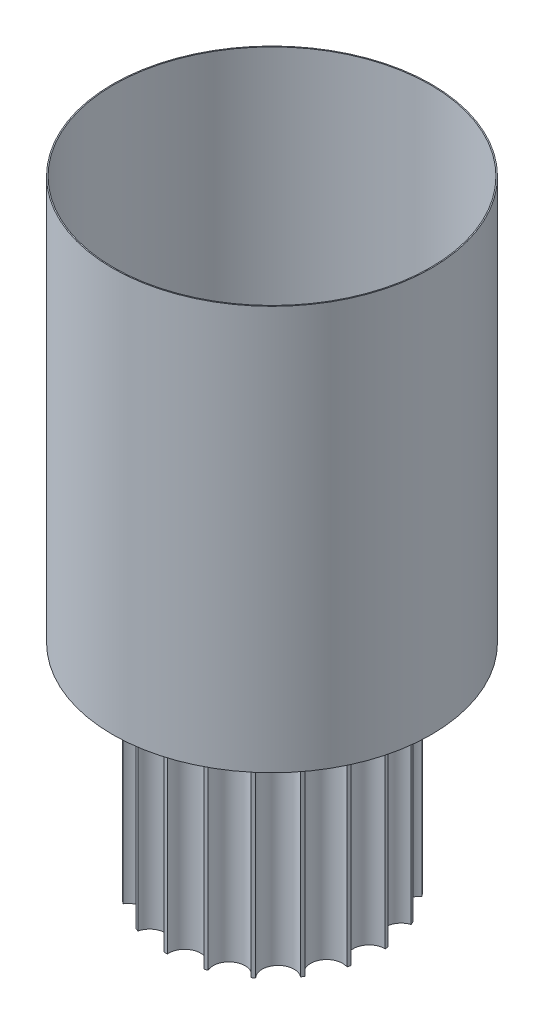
from build123d import *

# Parameters (mm, degrees)
CROQUIS1_R                = 100
SALIENTE_EXTRUIR1_DEPTH   = 200
CROQUIS2_R                = 15
CORTAR_EXTRUIR1_DEPTH     = 200
CROQUIS5_R                = 75
CORTAR_EXTRUIR2_DEPTH     = 180
CROQUIS6_R                = 5
CORTAR_EXTRUIR3_DEPTH     = 180
REDONDEO1_R               = 2
CROQUIS3_R                = 80
SALIENTE_EXTRUIR2_DEPTH   = 3
CROQUIS4_R                = 100
SALIENTE_EXTRUIR3_DEPTH   = 3
CROQUIS7_R                = 10
SALIENTE_EXTRUIR4_DEPTH   = 0.01
CROQUIS8_R                = 150
CROQUIS8_R_2              = 149
SALIENTE_EXTRUIR5_DEPTH   = 380
CROQUIS9_R                = 5
SALIENTE_EXTRUIR6_DEPTH   = 3
SALIENTE_EXTRUIR6_2_DEPTH = 3
SALIENTE_EXTRUIR6_3_DEPTH = 3
SALIENTE_EXTRUIR6_4_DEPTH = 3


with BuildPart() as part:
    # Croquis1 → Saliente-Extruir1 (new body)
    with BuildSketch(Plane(origin=(0, 0, 0), x_dir=(1, 0, 0), z_dir=(0, 1, 0))):
        with Locations(Location((0, 0, 0), (0, 0, 270))):
            Circle(CROQUIS1_R)
    extrude(amount=SALIENTE_EXTRUIR1_DEPTH)

    # Croquis2 → Cortar-Extruir1 (cut)
    with BuildSketch(Plane(origin=(0, 200, 0), x_dir=(1, 0, 0), z_dir=(0, 1, 0))):
        with Locations((0, 100)):
            Circle(CROQUIS2_R)
        with Locations((32.46994692, 94.58172417)):
            Circle(CROQUIS2_R)
        with Locations((61.421271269, 78.91405094)):
            Circle(CROQUIS2_R)
        with Locations((83.716647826, 54.694815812)):
            Circle(CROQUIS2_R)
        with Locations((96.940026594, 24.548548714)):
            Circle(CROQUIS2_R)
        with Locations((99.658449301, -8.257934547)):
            Circle(CROQUIS2_R)
        with Locations((91.577332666, -40.169542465)):
            Circle(CROQUIS2_R)
        with Locations((73.572391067, -67.728157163)):
            Circle(CROQUIS2_R)
        with Locations((47.594739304, -87.947375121)):
            Circle(CROQUIS2_R)
        with Locations((16.459459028, -98.63613034)):
            Circle(CROQUIS2_R)
        with Locations((-16.459459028, -98.63613034)):
            Circle(CROQUIS2_R)
        with Locations((-47.594739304, -87.947375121)):
            Circle(CROQUIS2_R)
        with Locations((-73.572391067, -67.728157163)):
            Circle(CROQUIS2_R)
        with Locations((-91.577332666, -40.169542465)):
            Circle(CROQUIS2_R)
        with Locations((-99.658449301, -8.257934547)):
            Circle(CROQUIS2_R)
        with Locations((-96.940026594, 24.548548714)):
            Circle(CROQUIS2_R)
        with Locations((-83.716647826, 54.694815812)):
            Circle(CROQUIS2_R)
        with Locations((-61.421271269, 78.91405094)):
            Circle(CROQUIS2_R)
        with Locations((-32.46994692, 94.58172417)):
            Circle(CROQUIS2_R)
    extrude(amount=-CORTAR_EXTRUIR1_DEPTH, mode=Mode.SUBTRACT)

    # Croquis5 → Cortar-Extruir2 (cut)
    with BuildSketch(Plane(origin=(0, 200, 0), x_dir=(1, 0, 0), z_dir=(0, 1, 0))):
        with Locations(Location((0, 0, 0), (0, 0, 270))):
            Circle(CROQUIS5_R)
    extrude(amount=-CORTAR_EXTRUIR2_DEPTH, mode=Mode.SUBTRACT)

    # Croquis6 → Cortar-Extruir3 (cut)
    with BuildSketch(Plane(origin=(0, 20, 0), x_dir=(1, 0, 0), z_dir=(0, 1, 0))):
        with Locations(Location((0, 0, 0), (0, 0, 270))):
            Circle(CROQUIS6_R)
    extrude(amount=-CORTAR_EXTRUIR3_DEPTH, mode=Mode.SUBTRACT)

    # Redondeo1
    redondeo1_edges = [part.edges().sort_by_distance(p)[0] for p in [
        (0, 200, -75),
    ]]
    fillet(redondeo1_edges, radius=REDONDEO1_R)


with BuildPart() as body_2:
    # Croquis3 → Saliente-Extruir2 (new body)
    with BuildSketch(Plane.XZ):
        with Locations(Location((0, 0, 0), (0, 0, 270))):
            Circle(CROQUIS3_R)
    extrude(amount=SALIENTE_EXTRUIR2_DEPTH)


with BuildPart() as body_3:
    # Croquis4 → Saliente-Extruir3 (new body)
    with BuildSketch(Plane(origin=(0, 200, 0), x_dir=(1, 0, 0), z_dir=(0, 1, 0))):
        with Locations(Location((0, 0, 0), (0, 0, 270))):
            Circle(CROQUIS4_R)
    extrude(amount=SALIENTE_EXTRUIR3_DEPTH)

    # Croquis7 → Saliente-Extruir4 (add)
    with BuildSketch(Plane(origin=(0, 203, 0), x_dir=(1, 0, 0), z_dir=(0, 1, 0))):
        with Locations(Location((0, 0, 0), (0, 0, 90))):
            Circle(CROQUIS7_R)
    extrude(amount=SALIENTE_EXTRUIR4_DEPTH)


with BuildPart() as body_4:
    # Croquis8 → Saliente-Extruir5 (new body)
    with BuildSketch(Plane(origin=(0, 203.01, 0), x_dir=(1, 0, 0), z_dir=(0, 1, 0))):
        with Locations(Location((0, 0, 0), (0, 0, 270))):
            Circle(CROQUIS8_R)
        with Locations(Location((0, 0, 0), (0, 0, 270))):
            Circle(CROQUIS8_R_2, mode=Mode.SUBTRACT)
    extrude(amount=SALIENTE_EXTRUIR5_DEPTH)


with BuildPart() as body_5:
    # Croquis9 → Saliente-Extruir6 (new body)
    with BuildSketch(Plane.XZ.offset(3)):
        with Locations(Location((47.5, 47.5, 0), (0, 0, 270))):
            Circle(CROQUIS9_R)
    extrude(amount=SALIENTE_EXTRUIR6_DEPTH)


with BuildPart() as body_6:
    # Croquis9 → Saliente-Extruir6 2 (new body)
    with BuildSketch(Plane.XZ.offset(3)):
        with Locations(Location((-47.5, 47.5, 0), (0, 0, 270))):
            Circle(CROQUIS9_R)
    extrude(amount=SALIENTE_EXTRUIR6_2_DEPTH)


with BuildPart() as body_7:
    # Croquis9 → Saliente-Extruir6 3 (new body)
    with BuildSketch(Plane.XZ.offset(3)):
        with Locations(Location((-47.5, -47.5, 0), (0, 0, 270))):
            Circle(CROQUIS9_R)
    extrude(amount=SALIENTE_EXTRUIR6_3_DEPTH)


with BuildPart() as body_8:
    # Croquis9 → Saliente-Extruir6 4 (new body)
    with BuildSketch(Plane.XZ.offset(3)):
        with Locations(Location((47.5, -47.5, 0), (0, 0, 270))):
            Circle(CROQUIS9_R)
    extrude(amount=SALIENTE_EXTRUIR6_4_DEPTH)


solid = Compound([part.part, body_2.part, body_3.part, body_4.part, body_5.part, body_6.part, body_7.part, body_8.part])
